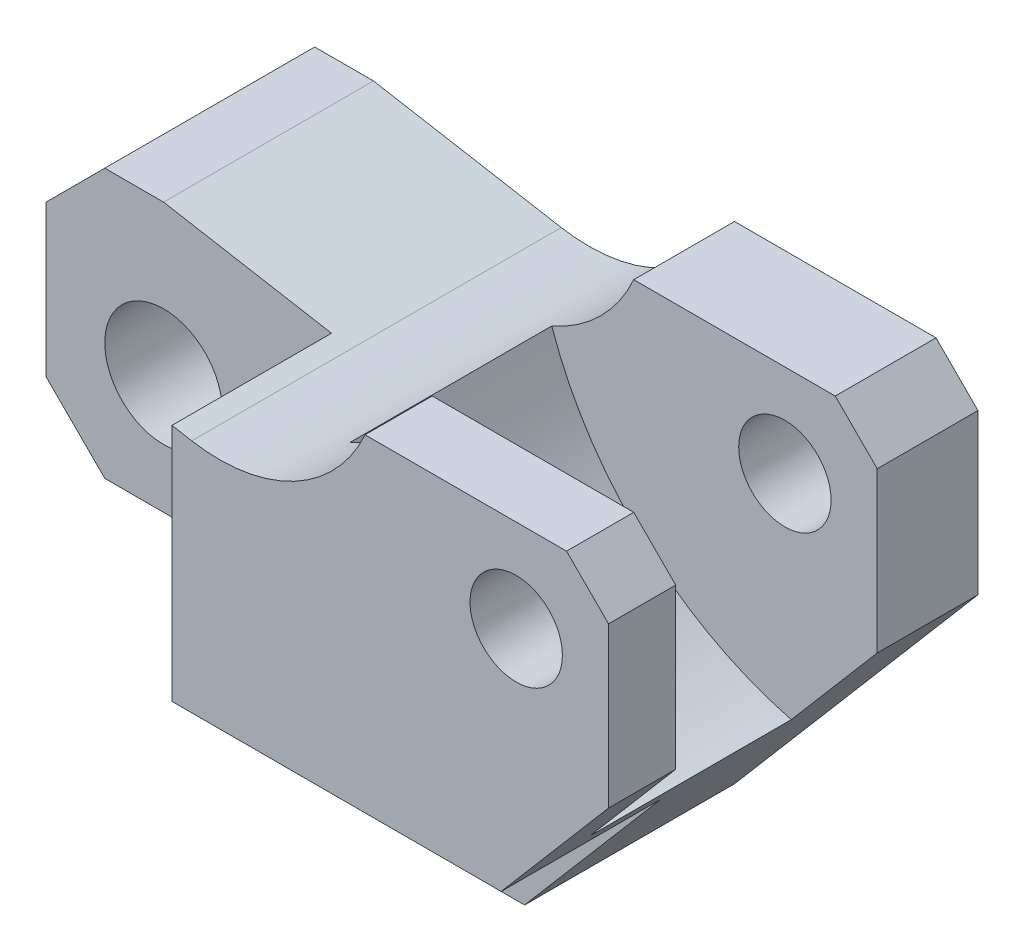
from build123d import *

# Parameters (mm, degrees)
ESQUISSE1_R             = 7
BOSS_EXTRU_1_DEPTH      = 44
ENL_V_MAT_EXTRU_3_DEPTH = 24
ENL_V_START             = -19
ENL_V_MAT_EXTRU_6_DEPTH = 19
ESQUISSE6_R             = 5.5
ENL_V_MAT_EXTRU_7_DEPTH = 73


with BuildPart() as part:
    # Esquisse1 → Boss.-Extru.1 (new body)
    with BuildSketch(Plane.XY):
        with BuildLine():
            Line((0.139440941, 21.413889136), (24.139440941, 21.413889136))
            Line((24.139440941, 21.413889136), (29.139440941, 16.413889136))
            Line((29.139440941, 16.413889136), (29.139440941, -2.586110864))
            Line((29.139440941, -2.586110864), (0.139440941, -36.586110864))
            Line((0.139440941, -36.586110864), (-5.563579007, -36.586110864))
            ThreePointArc((-5.563579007, -36.586110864), (-10.002551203, -29.701782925), (-12.339381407, -21.850816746))
            ThreePointArc((-12.339381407, -21.850816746), (-14.019784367, -18.799524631), (-17.285020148, -17.586110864))
            Line((-17.285020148, -17.586110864), (-49.860559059, -17.586110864))
            Line((-49.860559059, -17.586110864), (-56.860559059, -10.586110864))
            Line((-56.860559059, -10.586110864), (-56.860559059, 7.413889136))
            Line((-56.860559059, 7.413889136), (-49.860559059, 14.413889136))
            Line((-49.860559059, 14.413889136), (-42.860559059, 14.413889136))
            Line((-42.860559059, 14.413889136), (-20.499178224, 10.470974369))
            ThreePointArc((-20.499178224, 10.470974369), (-8.299460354, 12.395933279), (0.139440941, 21.413889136))
        make_face()
        with Locations((-42.860559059, -3.586110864)):
            Circle(ESQUISSE1_R, mode=Mode.SUBTRACT)
    extrude(amount=BOSS_EXTRU_1_DEPTH)

    # Esquisse4 → Enl_v. mat.-Extru.3 (cut)
    with BuildSketch(Plane(origin=(0, 0, 12), x_dir=(-1, 0, 0), z_dir=(0, 0, -1))):
        with BuildLine():
            Line((-0.139440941, 21.413889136), (-24.139440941, 21.413889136))
            Line((-24.139440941, 21.413889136), (-29.139440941, 16.413889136))
            Line((-29.139440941, 16.413889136), (-29.139440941, -2.586110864))
            Line((-29.139440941, -2.586110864), (-18.904146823, -14.586110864))
            ThreePointArc((-18.904146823, -14.586110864), (-1.323703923, -5.005405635), (9.62362251, 11.758183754))
            ThreePointArc((9.62362251, 11.758183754), (3.839314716, 15.673222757), (-0.139440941, 21.413889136))
        make_face()
    extrude(amount=-ENL_V_MAT_EXTRU_3_DEPTH, mode=Mode.SUBTRACT)

    # Esquisse5 → Enl_v. mat.-Extru.6 (cut)
    with BuildSketch(Plane.XY.offset(44).offset(ENL_V_START)):
        with BuildLine():
            Line((-17.285020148, -17.586110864), (16.345323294, -17.586110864))
            Line((16.345323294, -17.586110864), (0.139440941, -36.586110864))
            Line((0.139440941, -36.586110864), (-5.563579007, -36.586110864))
            ThreePointArc((-5.563579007, -36.586110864), (-10.002551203, -29.701782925), (-12.339381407, -21.850816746))
            ThreePointArc((-12.339381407, -21.850816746), (-14.019784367, -18.799524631), (-17.285020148, -17.586110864))
        make_face()
        Polygon((-22.860559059, -17.586110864), (-22.860559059, 10.887349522), (-42.860559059, 14.413889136), (-49.860559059, 14.413889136), (-56.860559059, 7.413889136), (-56.860559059, -10.586110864), (-49.860559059, -17.586110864), align=None)
    extrude(amount=ENL_V_MAT_EXTRU_6_DEPTH, mode=Mode.SUBTRACT)

    # Esquisse6 → Enl_v. mat.-Extru.7 (cut)
    with BuildSketch(Plane.XY.offset(44)):
        with Locations((18.139440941, 10.413889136)):
            Circle(ESQUISSE6_R)
    extrude(amount=-ENL_V_MAT_EXTRU_7_DEPTH, mode=Mode.SUBTRACT)


solid = part.part
